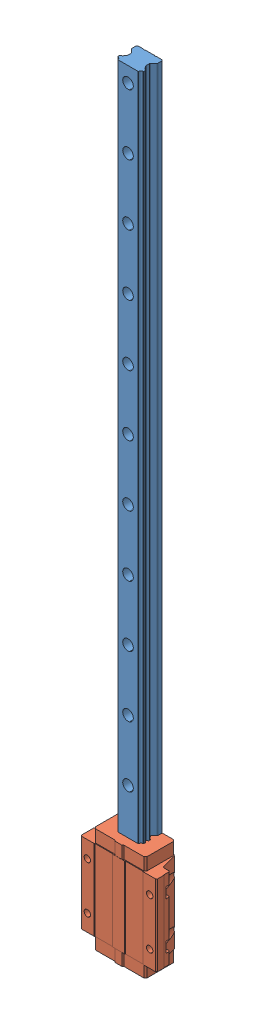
SolidWorks assembly HXW20HA1R1000ZOC+E22020.step.sldasm, configuration 默认 (file format 13000). Lengths in mm.
Overall size (100 1018 41.5).
2 component instances, 2 part files, 0 mates.
Components (placement in the parent):
- HLR20R1000 E=20-1: HLR20R1000 E=20.SLDPRT [默认] at origin size (34 1000 29)
- HLW20HC-1: HLW20HC.SLDPRT [默认] at (0 51.1 12.5) size (100 138.2 40.5)
